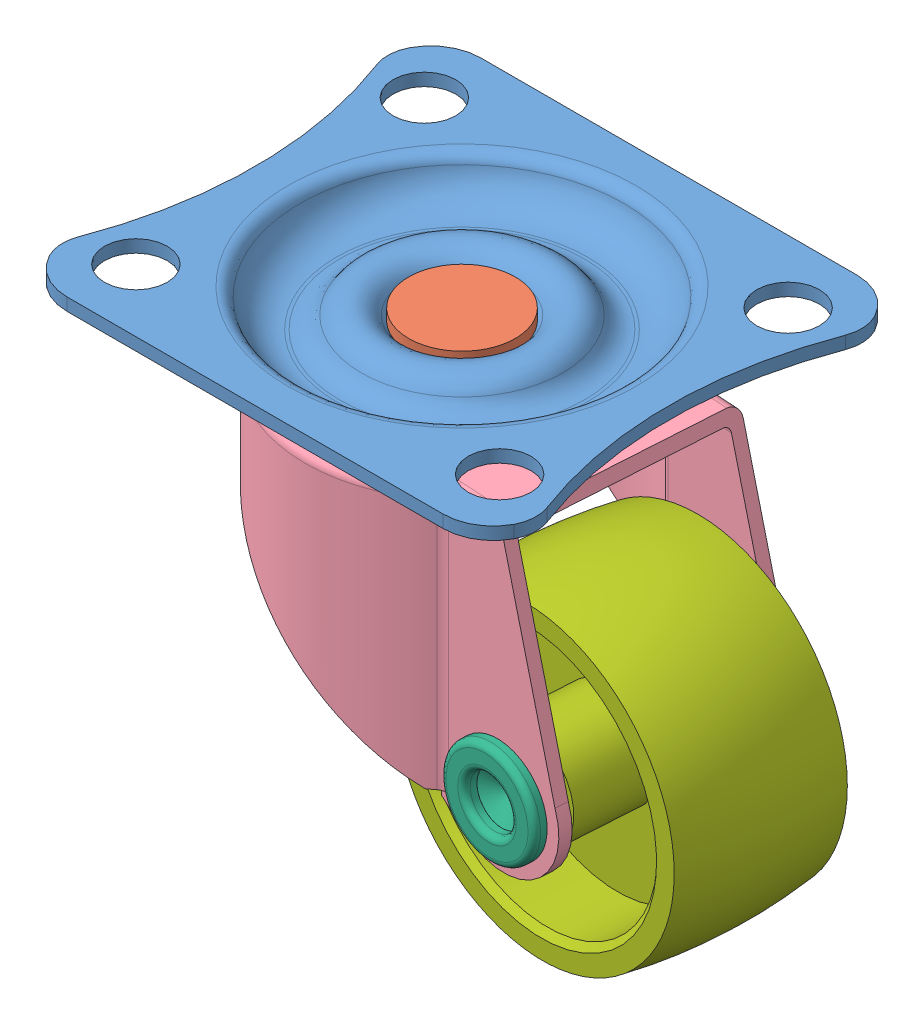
SolidWorks assembly Caster Wheel d=20mm.SLDASM, configuration Défaut (file format 14000). Lengths in mm.
Overall size (46.31 37.54 33).
9 component instances, 7 part files, 4 mates.
Components (placement in the parent):
- A - Base-1: A - Base.SLDASM [Défaut] at (1.134 3.654 0) size (37.76 8 33)
  - Base-1: Base.SLDPRT [Défaut] at (-1.008 2.021 37.7647) size (37.76 4 33)
  - Rivet A-1: Rivet A.SLDPRT [Défaut] at (-1.008 -0.979 37.7647) size (8.5 5.5 8.5)
  - Rivet B-1: Rivet B.SLDPRT [Défaut] at (-1.008 -3.979 37.7647) size (10.5 5 10.5)
- B - Chape-1: B - Chape.SLDASM [Défaut] at (3.7589 -12.2218 6.9338) x (0.997956 0 0.063898) z (-0.063898 0 0.997956) size (31 24 25)
  - Chape-1: Chape.SLDPRT [Défaut] at (11.8446 -6.1032 31) size (31 24 25)
  - Rivet2 A-1: Rivet2 A.SLDPRT [Défaut] at (11.8446 -6.1032 22) size (10 10 19.48)
  - Rivet2 B-1: Rivet2 B.SLDPRT [Défaut] at (11.8446 -6.1032 40) x (0 0 -1) z (0.975007 0.222176 0) size (14 8 8)
- C - Galet-1: C - Galet.SLDPRT [Défaut] at (13.5984 -18.325 38.6273) x (0.994184 -0.086867 0.063656) z (-0.063898 0 0.997956) size (25 25 14)
Mates (geometry in assembly coordinates):
- Coaxiale1: concentric aligned: cylinder of A - Base-1/Base-1 through (0.126 11.0488 37.7647) axis (0 1 0) radius 1.5; cylinder of B - Chape-1/Chape-1 through (0.126 -23.325 37.7647) axis (0 1 0) radius 1.5
- Distance1: distance = 5 mm aligned: plane of A - Base-1/Base-1 through (-14.874 5.675 37.7647) normal (0 1 0); plane of B - Chape-1/Chape-1 through (-12.9235 0.675 45.9476) normal (0 1 0)
- Coaxiale2: concentric aligned: cylinder of B - Chape-1/Chape-1 through (14.1735 -18.325 29.6457) axis (-0.063898 0 0.997956) radius 3; cylinder of C - Galet-1 through (13.2972 -18.325 43.3324) axis (-0.063898 0 0.997956) radius 3
- Distance2: distance = 1 mm anti-aligned: plane of C - Galet-1 through (14.3058 -15.3363 31.6583) normal (0.063898 0 -0.997956); plane of B - Chape-1/Chape-1 through (-11.8373 0.675 28.9823) normal (-0.063898 0 0.997956)
